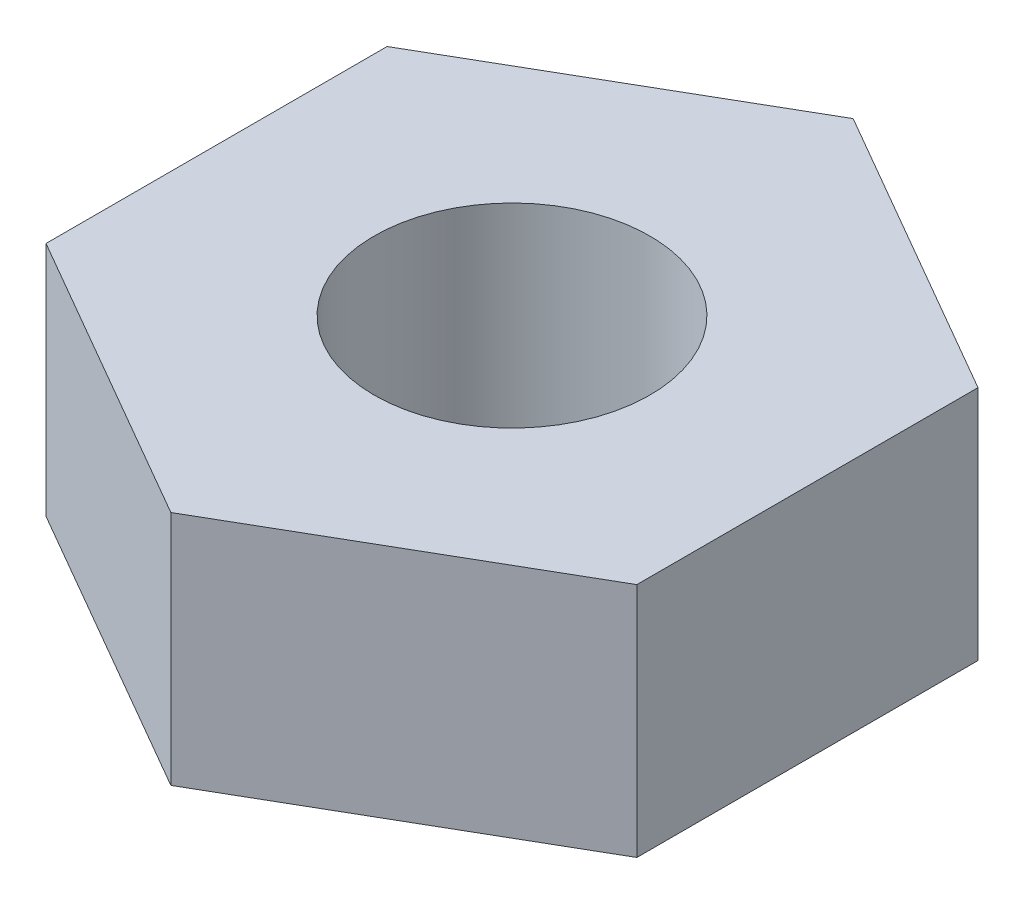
ISO-10303-21;
HEADER;
FILE_DESCRIPTION(('STEP AP214'),'2;1');
FILE_NAME('part.step','',(''),(''),'','','');
FILE_SCHEMA(('AUTOMOTIVE_DESIGN { 1 0 10303 214 1 1 1 1 }'));
ENDSEC;
DATA;
#1=APPLICATION_CONTEXT('core data for automotive mechanical design processes');
#2=APPLICATION_PROTOCOL_DEFINITION('international standard','automotive_design',2000,#1);
#3=PRODUCT_CONTEXT('',#1,'mechanical');
#4=PRODUCT('Part','Part','',(#3));
#5=PRODUCT_RELATED_PRODUCT_CATEGORY('part','',(#4));
#6=PRODUCT_DEFINITION_FORMATION('','',#4);
#7=PRODUCT_DEFINITION_CONTEXT('part definition',#1,'design');
#8=PRODUCT_DEFINITION('design','',#6,#7);
#9=PRODUCT_DEFINITION_SHAPE('','',#8);
#10=(LENGTH_UNIT() NAMED_UNIT(*) SI_UNIT(.MILLI.,.METRE.));
#11=(NAMED_UNIT(*) PLANE_ANGLE_UNIT() SI_UNIT($,.RADIAN.));
#12=(NAMED_UNIT(*) SI_UNIT($,.STERADIAN.) SOLID_ANGLE_UNIT());
#13=UNCERTAINTY_MEASURE_WITH_UNIT(LENGTH_MEASURE(1.E-05),#10,'distance_accuracy_value','');
#14=(GEOMETRIC_REPRESENTATION_CONTEXT(3) GLOBAL_UNCERTAINTY_ASSIGNED_CONTEXT((#13)) GLOBAL_UNIT_ASSIGNED_CONTEXT((#10,
#11,#12)) REPRESENTATION_CONTEXT('',''));
#15=CARTESIAN_POINT('',(0.,0.,0.));
#16=DIRECTION('',(0.,0.,1.));
#17=DIRECTION('',(1.,0.,0.));
#18=AXIS2_PLACEMENT_3D('',#15,#16,#17);
#19=CARTESIAN_POINT('',(0.,1.2,-1.73205080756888));
#20=DIRECTION('',(0.,-1.,0.));
#21=DIRECTION('',(0.,0.,-1.));
#22=AXIS2_PLACEMENT_3D('',#19,#20,#21);
#23=PLANE('',#22);
#24=DIRECTION('',(-0.866025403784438,0.,0.500000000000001));
#25=VECTOR('',#24,1.);
#26=CARTESIAN_POINT('',(0.,1.2,-1.73205080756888));
#27=LINE('',#26,#25);
#28=CARTESIAN_POINT('',(0.,1.2,-1.73205080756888));
#29=VERTEX_POINT('',#28);
#30=CARTESIAN_POINT('',(-1.5,1.2,-0.866025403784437));
#31=VERTEX_POINT('',#30);
#32=EDGE_CURVE('E128',#29,#31,#27,.T.);
#33=ORIENTED_EDGE('',*,*,#32,.T.);
#34=DIRECTION('',(0.,0.,1.));
#35=VECTOR('',#34,1.);
#36=CARTESIAN_POINT('',(-1.5,1.2,-0.866025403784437));
#37=LINE('',#36,#35);
#38=CARTESIAN_POINT('',(-1.5,1.2,0.866025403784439));
#39=VERTEX_POINT('',#38);
#40=EDGE_CURVE('E86',#31,#39,#37,.T.);
#41=ORIENTED_EDGE('',*,*,#40,.T.);
#42=DIRECTION('',(0.866025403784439,0.,0.5));
#43=VECTOR('',#42,1.);
#44=CARTESIAN_POINT('',(-1.5,1.2,0.866025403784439));
#45=LINE('',#44,#43);
#46=CARTESIAN_POINT('',(0.,1.2,1.73205080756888));
#47=VERTEX_POINT('',#46);
#48=EDGE_CURVE('E99',#39,#47,#45,.T.);
#49=ORIENTED_EDGE('',*,*,#48,.T.);
#50=DIRECTION('',(0.866025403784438,0.,-0.500000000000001));
#51=VECTOR('',#50,1.);
#52=CARTESIAN_POINT('',(0.,1.2,1.73205080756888));
#53=LINE('',#52,#51);
#54=CARTESIAN_POINT('',(1.5,1.2,0.866025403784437));
#55=VERTEX_POINT('',#54);
#56=EDGE_CURVE('E93',#47,#55,#53,.T.);
#57=ORIENTED_EDGE('',*,*,#56,.T.);
#58=DIRECTION('',(0.,0.,-1.));
#59=VECTOR('',#58,1.);
#60=CARTESIAN_POINT('',(1.5,1.2,0.866025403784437));
#61=LINE('',#60,#59);
#62=CARTESIAN_POINT('',(1.5,1.2,-0.866025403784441));
#63=VERTEX_POINT('',#62);
#64=EDGE_CURVE('E97',#55,#63,#61,.T.);
#65=ORIENTED_EDGE('',*,*,#64,.T.);
#66=DIRECTION('',(-0.866025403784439,0.,-0.5));
#67=VECTOR('',#66,1.);
#68=CARTESIAN_POINT('',(1.5,1.2,-0.866025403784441));
#69=LINE('',#68,#67);
#70=EDGE_CURVE('E49',#63,#29,#69,.T.);
#71=ORIENTED_EDGE('',*,*,#70,.T.);
#72=EDGE_LOOP('',(#33,#41,#49,#57,#65,#71));
#73=FACE_BOUND('',#72,.T.);
#74=CARTESIAN_POINT('',(0.,1.2,0.));
#75=DIRECTION('',(0.,1.,0.));
#76=DIRECTION('',(0.,0.,1.));
#77=AXIS2_PLACEMENT_3D('',#74,#75,#76);
#78=CIRCLE('',#77,0.7);
#79=CARTESIAN_POINT('',(0.,1.2,0.7));
#80=VERTEX_POINT('',#79);
#81=EDGE_CURVE('E121',#80,#80,#78,.T.);
#82=ORIENTED_EDGE('',*,*,#81,.F.);
#83=EDGE_LOOP('',(#82));
#84=FACE_BOUND('',#83,.T.);
#85=ADVANCED_FACE('F32',(#73,#84),#23,.F.);
#86=CARTESIAN_POINT('',(0.,0.,-1.73205080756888));
#87=DIRECTION('',(0.,-1.,0.));
#88=DIRECTION('',(0.,0.,-1.));
#89=AXIS2_PLACEMENT_3D('',#86,#87,#88);
#90=PLANE('',#89);
#91=DIRECTION('',(-0.866025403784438,0.,0.500000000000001));
#92=VECTOR('',#91,1.);
#93=CARTESIAN_POINT('',(0.,0.,-1.73205080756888));
#94=LINE('',#93,#92);
#95=CARTESIAN_POINT('',(0.,0.,-1.73205080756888));
#96=VERTEX_POINT('',#95);
#97=CARTESIAN_POINT('',(-1.5,0.,-0.866025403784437));
#98=VERTEX_POINT('',#97);
#99=EDGE_CURVE('E117',#96,#98,#94,.T.);
#100=ORIENTED_EDGE('',*,*,#99,.F.);
#101=DIRECTION('',(-0.866025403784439,0.,-0.5));
#102=VECTOR('',#101,1.);
#103=CARTESIAN_POINT('',(1.5,0.,-0.866025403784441));
#104=LINE('',#103,#102);
#105=CARTESIAN_POINT('',(1.5,0.,-0.866025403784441));
#106=VERTEX_POINT('',#105);
#107=EDGE_CURVE('E78',#106,#96,#104,.T.);
#108=ORIENTED_EDGE('',*,*,#107,.F.);
#109=DIRECTION('',(0.,0.,-1.));
#110=VECTOR('',#109,1.);
#111=CARTESIAN_POINT('',(1.5,0.,0.866025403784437));
#112=LINE('',#111,#110);
#113=CARTESIAN_POINT('',(1.5,0.,0.866025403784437));
#114=VERTEX_POINT('',#113);
#115=EDGE_CURVE('E72',#114,#106,#112,.T.);
#116=ORIENTED_EDGE('',*,*,#115,.F.);
#117=DIRECTION('',(0.866025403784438,0.,-0.500000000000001));
#118=VECTOR('',#117,1.);
#119=CARTESIAN_POINT('',(0.,0.,1.73205080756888));
#120=LINE('',#119,#118);
#121=CARTESIAN_POINT('',(0.,0.,1.73205080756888));
#122=VERTEX_POINT('',#121);
#123=EDGE_CURVE('E107',#122,#114,#120,.T.);
#124=ORIENTED_EDGE('',*,*,#123,.F.);
#125=DIRECTION('',(0.866025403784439,0.,0.5));
#126=VECTOR('',#125,1.);
#127=CARTESIAN_POINT('',(-1.5,0.,0.866025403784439));
#128=LINE('',#127,#126);
#129=CARTESIAN_POINT('',(-1.5,0.,0.866025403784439));
#130=VERTEX_POINT('',#129);
#131=EDGE_CURVE('E123',#130,#122,#128,.T.);
#132=ORIENTED_EDGE('',*,*,#131,.F.);
#133=DIRECTION('',(0.,0.,1.));
#134=VECTOR('',#133,1.);
#135=CARTESIAN_POINT('',(-1.5,0.,-0.866025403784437));
#136=LINE('',#135,#134);
#137=EDGE_CURVE('E120',#98,#130,#136,.T.);
#138=ORIENTED_EDGE('',*,*,#137,.F.);
#139=EDGE_LOOP('',(#100,#108,#116,#124,#132,#138));
#140=FACE_BOUND('',#139,.T.);
#141=CARTESIAN_POINT('',(0.,0.,0.));
#142=DIRECTION('',(0.,1.,0.));
#143=DIRECTION('',(0.,0.,1.));
#144=AXIS2_PLACEMENT_3D('',#141,#142,#143);
#145=CIRCLE('',#144,0.7);
#146=CARTESIAN_POINT('',(0.,0.,0.7));
#147=VERTEX_POINT('',#146);
#148=EDGE_CURVE('E221',#147,#147,#145,.T.);
#149=ORIENTED_EDGE('',*,*,#148,.T.);
#150=EDGE_LOOP('',(#149));
#151=FACE_BOUND('',#150,.T.);
#152=ADVANCED_FACE('F137',(#140,#151),#90,.T.);
#153=CARTESIAN_POINT('',(0.,1.2,-1.73205080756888));
#154=DIRECTION('',(0.500000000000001,0.,0.866025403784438));
#155=DIRECTION('',(0.866025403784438,0.,-0.500000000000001));
#156=AXIS2_PLACEMENT_3D('',#153,#154,#155);
#157=PLANE('',#156);
#158=ORIENTED_EDGE('',*,*,#99,.T.);
#159=DIRECTION('',(0.,-1.,0.));
#160=VECTOR('',#159,1.);
#161=CARTESIAN_POINT('',(-1.5,1.2,-0.866025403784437));
#162=LINE('',#161,#160);
#163=EDGE_CURVE('E11',#31,#98,#162,.T.);
#164=ORIENTED_EDGE('',*,*,#163,.F.);
#165=ORIENTED_EDGE('',*,*,#32,.F.);
#166=DIRECTION('',(0.,-1.,0.));
#167=VECTOR('',#166,1.);
#168=CARTESIAN_POINT('',(0.,1.2,-1.73205080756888));
#169=LINE('',#168,#167);
#170=EDGE_CURVE('E113',#29,#96,#169,.T.);
#171=ORIENTED_EDGE('',*,*,#170,.T.);
#172=EDGE_LOOP('',(#158,#164,#165,#171));
#173=FACE_BOUND('',#172,.T.);
#174=ADVANCED_FACE('F34',(#173),#157,.F.);
#175=CARTESIAN_POINT('',(-1.5,1.2,-0.866025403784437));
#176=DIRECTION('',(1.,0.,0.));
#177=DIRECTION('',(0.,0.,-1.));
#178=AXIS2_PLACEMENT_3D('',#175,#176,#177);
#179=PLANE('',#178);
#180=ORIENTED_EDGE('',*,*,#137,.T.);
#181=DIRECTION('',(0.,-1.,0.));
#182=VECTOR('',#181,1.);
#183=CARTESIAN_POINT('',(-1.5,1.2,0.866025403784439));
#184=LINE('',#183,#182);
#185=EDGE_CURVE('E41',#39,#130,#184,.T.);
#186=ORIENTED_EDGE('',*,*,#185,.F.);
#187=ORIENTED_EDGE('',*,*,#40,.F.);
#188=ORIENTED_EDGE('',*,*,#163,.T.);
#189=EDGE_LOOP('',(#180,#186,#187,#188));
#190=FACE_BOUND('',#189,.T.);
#191=ADVANCED_FACE('F162',(#190),#179,.F.);
#192=CARTESIAN_POINT('',(-1.5,1.2,0.866025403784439));
#193=DIRECTION('',(0.5,0.,-0.866025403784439));
#194=DIRECTION('',(-0.866025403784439,0.,-0.5));
#195=AXIS2_PLACEMENT_3D('',#192,#193,#194);
#196=PLANE('',#195);
#197=ORIENTED_EDGE('',*,*,#131,.T.);
#198=DIRECTION('',(0.,-1.,0.));
#199=VECTOR('',#198,1.);
#200=CARTESIAN_POINT('',(0.,1.2,1.73205080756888));
#201=LINE('',#200,#199);
#202=EDGE_CURVE('E108',#47,#122,#201,.T.);
#203=ORIENTED_EDGE('',*,*,#202,.F.);
#204=ORIENTED_EDGE('',*,*,#48,.F.);
#205=ORIENTED_EDGE('',*,*,#185,.T.);
#206=EDGE_LOOP('',(#197,#203,#204,#205));
#207=FACE_BOUND('',#206,.T.);
#208=ADVANCED_FACE('F134',(#207),#196,.F.);
#209=CARTESIAN_POINT('',(0.,1.2,1.73205080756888));
#210=DIRECTION('',(-0.500000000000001,0.,-0.866025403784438));
#211=DIRECTION('',(-0.866025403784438,0.,0.500000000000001));
#212=AXIS2_PLACEMENT_3D('',#209,#210,#211);
#213=PLANE('',#212);
#214=ORIENTED_EDGE('',*,*,#123,.T.);
#215=DIRECTION('',(0.,-1.,0.));
#216=VECTOR('',#215,1.);
#217=CARTESIAN_POINT('',(1.5,1.2,0.866025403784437));
#218=LINE('',#217,#216);
#219=EDGE_CURVE('E104',#55,#114,#218,.T.);
#220=ORIENTED_EDGE('',*,*,#219,.F.);
#221=ORIENTED_EDGE('',*,*,#56,.F.);
#222=ORIENTED_EDGE('',*,*,#202,.T.);
#223=EDGE_LOOP('',(#214,#220,#221,#222));
#224=FACE_BOUND('',#223,.T.);
#225=ADVANCED_FACE('F105',(#224),#213,.F.);
#226=CARTESIAN_POINT('',(1.5,1.2,0.866025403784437));
#227=DIRECTION('',(-1.,0.,0.));
#228=DIRECTION('',(0.,0.,1.));
#229=AXIS2_PLACEMENT_3D('',#226,#227,#228);
#230=PLANE('',#229);
#231=ORIENTED_EDGE('',*,*,#115,.T.);
#232=DIRECTION('',(0.,-1.,0.));
#233=VECTOR('',#232,1.);
#234=CARTESIAN_POINT('',(1.5,1.2,-0.866025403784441));
#235=LINE('',#234,#233);
#236=EDGE_CURVE('E109',#63,#106,#235,.T.);
#237=ORIENTED_EDGE('',*,*,#236,.F.);
#238=ORIENTED_EDGE('',*,*,#64,.F.);
#239=ORIENTED_EDGE('',*,*,#219,.T.);
#240=EDGE_LOOP('',(#231,#237,#238,#239));
#241=FACE_BOUND('',#240,.T.);
#242=ADVANCED_FACE('F111',(#241),#230,.F.);
#243=CARTESIAN_POINT('',(1.5,1.2,-0.866025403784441));
#244=DIRECTION('',(-0.5,0.,0.866025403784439));
#245=DIRECTION('',(0.866025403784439,0.,0.5));
#246=AXIS2_PLACEMENT_3D('',#243,#244,#245);
#247=PLANE('',#246);
#248=ORIENTED_EDGE('',*,*,#107,.T.);
#249=ORIENTED_EDGE('',*,*,#170,.F.);
#250=ORIENTED_EDGE('',*,*,#70,.F.);
#251=ORIENTED_EDGE('',*,*,#236,.T.);
#252=EDGE_LOOP('',(#248,#249,#250,#251));
#253=FACE_BOUND('',#252,.T.);
#254=ADVANCED_FACE('F142',(#253),#247,.F.);
#255=CARTESIAN_POINT('',(0.,1.2,0.));
#256=DIRECTION('',(0.,-1.,0.));
#257=DIRECTION('',(0.,0.,-1.));
#258=AXIS2_PLACEMENT_3D('',#255,#256,#257);
#259=CYLINDRICAL_SURFACE('',#258,0.7);
#260=ORIENTED_EDGE('',*,*,#81,.T.);
#261=EDGE_LOOP('',(#260));
#262=FACE_BOUND('',#261,.T.);
#263=ORIENTED_EDGE('',*,*,#148,.F.);
#264=EDGE_LOOP('',(#263));
#265=FACE_BOUND('',#264,.T.);
#266=ADVANCED_FACE('F144',(#262,#265),#259,.F.);
#267=CLOSED_SHELL('',(#85,#152,#174,#191,#208,#225,#242,#254,#266));
#268=MANIFOLD_SOLID_BREP('B2',#267);
#269=ADVANCED_BREP_SHAPE_REPRESENTATION('',(#18,#268),#14);
#270=SHAPE_DEFINITION_REPRESENTATION(#9,#269);
ENDSEC;
END-ISO-10303-21;
